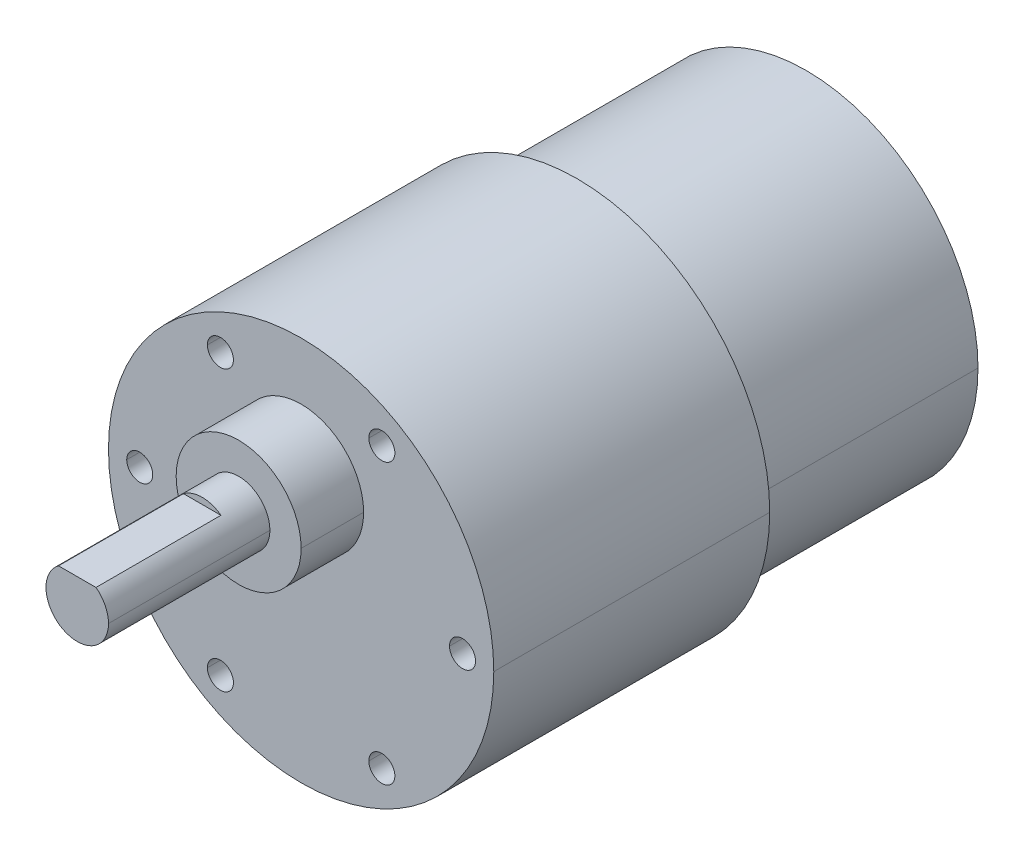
ISO-10303-21;
HEADER;
FILE_DESCRIPTION(('STEP AP214'),'2;1');
FILE_NAME('part.step','',(''),(''),'','','');
FILE_SCHEMA(('AUTOMOTIVE_DESIGN { 1 0 10303 214 1 1 1 1 }'));
ENDSEC;
DATA;
#1=APPLICATION_CONTEXT('core data for automotive mechanical design processes');
#2=APPLICATION_PROTOCOL_DEFINITION('international standard','automotive_design',2000,#1);
#3=PRODUCT_CONTEXT('',#1,'mechanical');
#4=PRODUCT('Part','Part','',(#3));
#5=PRODUCT_RELATED_PRODUCT_CATEGORY('part','',(#4));
#6=PRODUCT_DEFINITION_FORMATION('','',#4);
#7=PRODUCT_DEFINITION_CONTEXT('part definition',#1,'design');
#8=PRODUCT_DEFINITION('design','',#6,#7);
#9=PRODUCT_DEFINITION_SHAPE('','',#8);
#10=(LENGTH_UNIT() NAMED_UNIT(*) SI_UNIT(.MILLI.,.METRE.));
#11=(NAMED_UNIT(*) PLANE_ANGLE_UNIT() SI_UNIT($,.RADIAN.));
#12=(NAMED_UNIT(*) SI_UNIT($,.STERADIAN.) SOLID_ANGLE_UNIT());
#13=UNCERTAINTY_MEASURE_WITH_UNIT(LENGTH_MEASURE(1.E-05),#10,'distance_accuracy_value','');
#14=(GEOMETRIC_REPRESENTATION_CONTEXT(3) GLOBAL_UNCERTAINTY_ASSIGNED_CONTEXT((#13)) GLOBAL_UNIT_ASSIGNED_CONTEXT((#10,
#11,#12)) REPRESENTATION_CONTEXT('',''));
#15=CARTESIAN_POINT('',(0.,0.,0.));
#16=DIRECTION('',(0.,0.,1.));
#17=DIRECTION('',(1.,0.,0.));
#18=AXIS2_PLACEMENT_3D('',#15,#16,#17);
#19=CARTESIAN_POINT('',(0.,0.,-26.5));
#20=DIRECTION('',(0.,0.,-1.));
#21=DIRECTION('',(0.,-1.,0.));
#22=AXIS2_PLACEMENT_3D('',#19,#20,#21);
#23=PLANE('',#22);
#24=CARTESIAN_POINT('',(0.,0.,-26.5));
#25=DIRECTION('',(0.,0.,-1.));
#26=DIRECTION('',(-1.,0.,0.));
#27=AXIS2_PLACEMENT_3D('',#24,#25,#26);
#28=CIRCLE('',#27,9.65740322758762);
#29=CARTESIAN_POINT('',(-9.65740322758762,0.,-26.5));
#30=VERTEX_POINT('',#29);
#31=CARTESIAN_POINT('',(9.65740322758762,0.,-26.5));
#32=VERTEX_POINT('',#31);
#33=EDGE_CURVE('E286',#30,#32,#28,.T.);
#34=ORIENTED_EDGE('',*,*,#33,.T.);
#35=CARTESIAN_POINT('',(0.,0.,-26.5));
#36=DIRECTION('',(0.,0.,-1.));
#37=DIRECTION('',(-1.,0.,0.));
#38=AXIS2_PLACEMENT_3D('',#35,#36,#37);
#39=CIRCLE('',#38,9.65740322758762);
#40=EDGE_CURVE('E10',#32,#30,#39,.T.);
#41=ORIENTED_EDGE('',*,*,#40,.T.);
#42=EDGE_LOOP('',(#34,#41));
#43=FACE_BOUND('',#42,.T.);
#44=ADVANCED_FACE('F16',(#43),#23,.T.);
#45=CARTESIAN_POINT('',(0.,0.,-23.5));
#46=DIRECTION('',(0.,0.,-1.));
#47=DIRECTION('',(-1.,0.,0.));
#48=AXIS2_PLACEMENT_3D('',#45,#46,#47);
#49=CYLINDRICAL_SURFACE('',#48,9.65740322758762);
#50=DIRECTION('',(0.,0.,-1.));
#51=VECTOR('',#50,1.);
#52=CARTESIAN_POINT('',(9.65740322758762,0.,-23.5));
#53=LINE('',#52,#51);
#54=CARTESIAN_POINT('',(9.65740322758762,0.,-24.5));
#55=VERTEX_POINT('',#54);
#56=EDGE_CURVE('E280',#55,#32,#53,.T.);
#57=ORIENTED_EDGE('',*,*,#56,.F.);
#58=CARTESIAN_POINT('',(0.,0.,-24.5));
#59=DIRECTION('',(0.,0.,-1.));
#60=DIRECTION('',(-1.,0.,0.));
#61=AXIS2_PLACEMENT_3D('',#58,#59,#60);
#62=CIRCLE('',#61,9.65740322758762);
#63=CARTESIAN_POINT('',(-9.65740322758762,0.,-24.5));
#64=VERTEX_POINT('',#63);
#65=EDGE_CURVE('E275',#55,#64,#62,.T.);
#66=ORIENTED_EDGE('',*,*,#65,.T.);
#67=DIRECTION('',(0.,0.,-1.));
#68=VECTOR('',#67,1.);
#69=CARTESIAN_POINT('',(-9.65740322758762,0.,-23.5));
#70=LINE('',#69,#68);
#71=EDGE_CURVE('E273',#64,#30,#70,.T.);
#72=ORIENTED_EDGE('',*,*,#71,.T.);
#73=ORIENTED_EDGE('',*,*,#40,.F.);
#74=EDGE_LOOP('',(#57,#66,#72,#73));
#75=FACE_BOUND('',#74,.T.);
#76=ADVANCED_FACE('F18',(#75),#49,.T.);
#77=CARTESIAN_POINT('',(0.,0.,17.5979797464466));
#78=DIRECTION('',(0.,0.,-1.));
#79=DIRECTION('',(-1.,0.,0.));
#80=AXIS2_PLACEMENT_3D('',#77,#78,#79);
#81=CYLINDRICAL_SURFACE('',#80,8.);
#82=DIRECTION('',(0.,0.,-1.));
#83=VECTOR('',#82,1.);
#84=CARTESIAN_POINT('',(8.,0.,17.5979797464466));
#85=LINE('',#84,#83);
#86=CARTESIAN_POINT('',(8.,0.,-22.));
#87=VERTEX_POINT('',#86);
#88=CARTESIAN_POINT('',(8.,0.,-24.5));
#89=VERTEX_POINT('',#88);
#90=EDGE_CURVE('E314',#87,#89,#85,.T.);
#91=ORIENTED_EDGE('',*,*,#90,.F.);
#92=CARTESIAN_POINT('',(0.,0.,-22.));
#93=DIRECTION('',(0.,0.,1.));
#94=DIRECTION('',(-1.,0.,0.));
#95=AXIS2_PLACEMENT_3D('',#92,#93,#94);
#96=CIRCLE('',#95,8.);
#97=CARTESIAN_POINT('',(-8.,0.,-22.));
#98=VERTEX_POINT('',#97);
#99=EDGE_CURVE('E329',#98,#87,#96,.T.);
#100=ORIENTED_EDGE('',*,*,#99,.F.);
#101=DIRECTION('',(0.,0.,-1.));
#102=VECTOR('',#101,1.);
#103=CARTESIAN_POINT('',(-8.,0.,17.5979797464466));
#104=LINE('',#103,#102);
#105=CARTESIAN_POINT('',(-8.,0.,-24.5));
#106=VERTEX_POINT('',#105);
#107=EDGE_CURVE('E321',#98,#106,#104,.T.);
#108=ORIENTED_EDGE('',*,*,#107,.T.);
#109=CARTESIAN_POINT('',(0.,0.,-24.5));
#110=DIRECTION('',(0.,0.,-1.));
#111=DIRECTION('',(-1.,0.,0.));
#112=AXIS2_PLACEMENT_3D('',#109,#110,#111);
#113=CIRCLE('',#112,8.);
#114=EDGE_CURVE('E282',#89,#106,#113,.T.);
#115=ORIENTED_EDGE('',*,*,#114,.F.);
#116=EDGE_LOOP('',(#91,#100,#108,#115));
#117=FACE_BOUND('',#116,.T.);
#118=ADVANCED_FACE('F660',(#117),#81,.T.);
#119=CARTESIAN_POINT('',(-7.75,13.4233937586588,26.5));
#120=DIRECTION('',(0.,0.,1.));
#121=DIRECTION('',(1.,0.,0.));
#122=AXIS2_PLACEMENT_3D('',#119,#120,#121);
#123=CYLINDRICAL_SURFACE('',#122,1.25);
#124=DIRECTION('',(0.,0.,1.));
#125=VECTOR('',#124,1.);
#126=CARTESIAN_POINT('',(-9.,13.4233937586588,26.5));
#127=LINE('',#126,#125);
#128=CARTESIAN_POINT('',(-9.,13.4233937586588,19.));
#129=VERTEX_POINT('',#128);
#130=CARTESIAN_POINT('',(-9.,13.4233937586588,26.5));
#131=VERTEX_POINT('',#130);
#132=EDGE_CURVE('E319',#129,#131,#127,.T.);
#133=ORIENTED_EDGE('',*,*,#132,.F.);
#134=CARTESIAN_POINT('',(-7.75,13.4233937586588,19.));
#135=DIRECTION('',(0.,0.,1.));
#136=DIRECTION('',(1.,0.,0.));
#137=AXIS2_PLACEMENT_3D('',#134,#135,#136);
#138=CIRCLE('',#137,1.25);
#139=CARTESIAN_POINT('',(-6.5,13.4233937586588,19.));
#140=VERTEX_POINT('',#139);
#141=EDGE_CURVE('E20',#140,#129,#138,.T.);
#142=ORIENTED_EDGE('',*,*,#141,.F.);
#143=DIRECTION('',(0.,0.,1.));
#144=VECTOR('',#143,1.);
#145=CARTESIAN_POINT('',(-6.5,13.4233937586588,26.5));
#146=LINE('',#145,#144);
#147=CARTESIAN_POINT('',(-6.5,13.4233937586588,26.5));
#148=VERTEX_POINT('',#147);
#149=EDGE_CURVE('E356',#140,#148,#146,.T.);
#150=ORIENTED_EDGE('',*,*,#149,.T.);
#151=CARTESIAN_POINT('',(-7.75,13.4233937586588,26.5));
#152=DIRECTION('',(0.,0.,1.));
#153=DIRECTION('',(1.,0.,0.));
#154=AXIS2_PLACEMENT_3D('',#151,#152,#153);
#155=CIRCLE('',#154,1.25);
#156=EDGE_CURVE('E572',#148,#131,#155,.T.);
#157=ORIENTED_EDGE('',*,*,#156,.T.);
#158=EDGE_LOOP('',(#133,#142,#150,#157));
#159=FACE_BOUND('',#158,.T.);
#160=ADVANCED_FACE('F624',(#159),#123,.F.);
#161=CARTESIAN_POINT('',(-7.75,13.4233937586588,19.));
#162=DIRECTION('',(0.,0.,1.));
#163=DIRECTION('',(1.,0.,0.));
#164=AXIS2_PLACEMENT_3D('',#161,#162,#163);
#165=CONICAL_SURFACE('',#164,1.25,1.02974425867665);
#166=DIRECTION('',(-0.857167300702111,0.,0.515038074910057));
#167=VECTOR('',#166,1.);
#168=CARTESIAN_POINT('',(-9.,13.4233937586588,19.));
#169=LINE('',#168,#167);
#170=CARTESIAN_POINT('',(-7.75,13.4233937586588,18.2489242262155));
#171=VERTEX_POINT('',#170);
#172=EDGE_CURVE('E303',#171,#129,#169,.T.);
#173=ORIENTED_EDGE('',*,*,#172,.F.);
#174=DIRECTION('',(0.857167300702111,0.,0.515038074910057));
#175=VECTOR('',#174,1.);
#176=CARTESIAN_POINT('',(-6.5,13.4233937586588,19.));
#177=LINE('',#176,#175);
#178=EDGE_CURVE('E305',#171,#140,#177,.T.);
#179=ORIENTED_EDGE('',*,*,#178,.T.);
#180=ORIENTED_EDGE('',*,*,#141,.T.);
#181=EDGE_LOOP('',(#173,#179,#180));
#182=FACE_BOUND('',#181,.T.);
#183=ADVANCED_FACE('F620',(#182),#165,.F.);
#184=CARTESIAN_POINT('',(7.75,13.4233937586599,26.5));
#185=DIRECTION('',(0.,0.,1.));
#186=DIRECTION('',(1.,0.,0.));
#187=AXIS2_PLACEMENT_3D('',#184,#185,#186);
#188=CYLINDRICAL_SURFACE('',#187,1.25);
#189=DIRECTION('',(0.,0.,1.));
#190=VECTOR('',#189,1.);
#191=CARTESIAN_POINT('',(6.5,13.4233937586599,26.5));
#192=LINE('',#191,#190);
#193=CARTESIAN_POINT('',(6.5,13.4233937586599,19.));
#194=VERTEX_POINT('',#193);
#195=CARTESIAN_POINT('',(6.5,13.4233937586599,26.5));
#196=VERTEX_POINT('',#195);
#197=EDGE_CURVE('E359',#194,#196,#192,.T.);
#198=ORIENTED_EDGE('',*,*,#197,.F.);
#199=CARTESIAN_POINT('',(7.75,13.4233937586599,19.));
#200=DIRECTION('',(0.,0.,1.));
#201=DIRECTION('',(1.,0.,0.));
#202=AXIS2_PLACEMENT_3D('',#199,#200,#201);
#203=CIRCLE('',#202,1.25);
#204=CARTESIAN_POINT('',(9.,13.4233937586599,19.));
#205=VERTEX_POINT('',#204);
#206=EDGE_CURVE('E602',#205,#194,#203,.T.);
#207=ORIENTED_EDGE('',*,*,#206,.F.);
#208=DIRECTION('',(0.,0.,1.));
#209=VECTOR('',#208,1.);
#210=CARTESIAN_POINT('',(9.,13.4233937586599,26.5));
#211=LINE('',#210,#209);
#212=CARTESIAN_POINT('',(9.,13.4233937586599,26.5));
#213=VERTEX_POINT('',#212);
#214=EDGE_CURVE('E360',#205,#213,#211,.T.);
#215=ORIENTED_EDGE('',*,*,#214,.T.);
#216=CARTESIAN_POINT('',(7.75,13.4233937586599,26.5));
#217=DIRECTION('',(0.,0.,1.));
#218=DIRECTION('',(1.,0.,0.));
#219=AXIS2_PLACEMENT_3D('',#216,#217,#218);
#220=CIRCLE('',#219,1.25);
#221=EDGE_CURVE('E577',#213,#196,#220,.T.);
#222=ORIENTED_EDGE('',*,*,#221,.T.);
#223=EDGE_LOOP('',(#198,#207,#215,#222));
#224=FACE_BOUND('',#223,.T.);
#225=ADVANCED_FACE('F664',(#224),#188,.F.);
#226=CARTESIAN_POINT('',(7.75,13.4233937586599,19.));
#227=DIRECTION('',(0.,0.,1.));
#228=DIRECTION('',(1.,0.,0.));
#229=AXIS2_PLACEMENT_3D('',#226,#227,#228);
#230=CONICAL_SURFACE('',#229,1.25,1.02974425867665);
#231=DIRECTION('',(-0.857167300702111,0.,0.515038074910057));
#232=VECTOR('',#231,1.);
#233=CARTESIAN_POINT('',(6.5,13.4233937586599,19.));
#234=LINE('',#233,#232);
#235=CARTESIAN_POINT('',(7.75,13.4233937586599,18.2489242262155));
#236=VERTEX_POINT('',#235);
#237=EDGE_CURVE('E393',#236,#194,#234,.T.);
#238=ORIENTED_EDGE('',*,*,#237,.F.);
#239=DIRECTION('',(0.857167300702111,0.,0.515038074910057));
#240=VECTOR('',#239,1.);
#241=CARTESIAN_POINT('',(9.,13.4233937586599,19.));
#242=LINE('',#241,#240);
#243=EDGE_CURVE('E387',#236,#205,#242,.T.);
#244=ORIENTED_EDGE('',*,*,#243,.T.);
#245=ORIENTED_EDGE('',*,*,#206,.T.);
#246=EDGE_LOOP('',(#238,#244,#245));
#247=FACE_BOUND('',#246,.T.);
#248=ADVANCED_FACE('F661',(#247),#230,.F.);
#249=CARTESIAN_POINT('',(15.500000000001,1.66495789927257E-12,26.5));
#250=DIRECTION('',(0.,0.,1.));
#251=DIRECTION('',(1.,0.,0.));
#252=AXIS2_PLACEMENT_3D('',#249,#250,#251);
#253=CYLINDRICAL_SURFACE('',#252,1.25);
#254=DIRECTION('',(0.,0.,1.));
#255=VECTOR('',#254,1.);
#256=CARTESIAN_POINT('',(14.2500000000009,1.66511098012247E-12,26.5));
#257=LINE('',#256,#255);
#258=CARTESIAN_POINT('',(14.2500000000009,1.66511098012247E-12,19.));
#259=VERTEX_POINT('',#258);
#260=CARTESIAN_POINT('',(14.2500000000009,1.66511098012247E-12,26.5));
#261=VERTEX_POINT('',#260);
#262=EDGE_CURVE('E401',#259,#261,#257,.T.);
#263=ORIENTED_EDGE('',*,*,#262,.F.);
#264=CARTESIAN_POINT('',(15.500000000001,1.66495789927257E-12,19.));
#265=DIRECTION('',(0.,0.,1.));
#266=DIRECTION('',(1.,0.,0.));
#267=AXIS2_PLACEMENT_3D('',#264,#265,#266);
#268=CIRCLE('',#267,1.25);
#269=CARTESIAN_POINT('',(16.750000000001,1.66495789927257E-12,19.));
#270=VERTEX_POINT('',#269);
#271=EDGE_CURVE('E601',#270,#259,#268,.T.);
#272=ORIENTED_EDGE('',*,*,#271,.F.);
#273=DIRECTION('',(0.,0.,1.));
#274=VECTOR('',#273,1.);
#275=CARTESIAN_POINT('',(16.750000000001,1.66495789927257E-12,26.5));
#276=LINE('',#275,#274);
#277=CARTESIAN_POINT('',(16.750000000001,1.66495789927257E-12,26.5));
#278=VERTEX_POINT('',#277);
#279=EDGE_CURVE('E418',#270,#278,#276,.T.);
#280=ORIENTED_EDGE('',*,*,#279,.T.);
#281=CARTESIAN_POINT('',(15.500000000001,1.66495789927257E-12,26.5));
#282=DIRECTION('',(0.,0.,1.));
#283=DIRECTION('',(1.,0.,0.));
#284=AXIS2_PLACEMENT_3D('',#281,#282,#283);
#285=CIRCLE('',#284,1.25);
#286=EDGE_CURVE('E540',#278,#261,#285,.T.);
#287=ORIENTED_EDGE('',*,*,#286,.T.);
#288=EDGE_LOOP('',(#263,#272,#280,#287));
#289=FACE_BOUND('',#288,.T.);
#290=ADVANCED_FACE('F667',(#289),#253,.F.);
#291=CARTESIAN_POINT('',(15.500000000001,1.66495789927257E-12,19.));
#292=DIRECTION('',(0.,0.,1.));
#293=DIRECTION('',(1.,0.,0.));
#294=AXIS2_PLACEMENT_3D('',#291,#292,#293);
#295=CONICAL_SURFACE('',#294,1.25,1.02974425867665);
#296=DIRECTION('',(-0.857167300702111,0.,0.515038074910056));
#297=VECTOR('',#296,1.);
#298=CARTESIAN_POINT('',(14.2500000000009,1.66511098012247E-12,19.));
#299=LINE('',#298,#297);
#300=CARTESIAN_POINT('',(15.500000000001,1.66495789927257E-12,18.2489242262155));
#301=VERTEX_POINT('',#300);
#302=EDGE_CURVE('E434',#301,#259,#299,.T.);
#303=ORIENTED_EDGE('',*,*,#302,.F.);
#304=DIRECTION('',(0.857167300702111,0.,0.515038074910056));
#305=VECTOR('',#304,1.);
#306=CARTESIAN_POINT('',(16.750000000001,1.66495789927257E-12,19.));
#307=LINE('',#306,#305);
#308=EDGE_CURVE('E431',#301,#270,#307,.T.);
#309=ORIENTED_EDGE('',*,*,#308,.T.);
#310=ORIENTED_EDGE('',*,*,#271,.T.);
#311=EDGE_LOOP('',(#303,#309,#310));
#312=FACE_BOUND('',#311,.T.);
#313=ADVANCED_FACE('F670',(#312),#295,.F.);
#314=CARTESIAN_POINT('',(7.75000000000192,-13.4233937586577,26.5));
#315=DIRECTION('',(0.,0.,1.));
#316=DIRECTION('',(1.,0.,0.));
#317=AXIS2_PLACEMENT_3D('',#314,#315,#316);
#318=CYLINDRICAL_SURFACE('',#317,1.25);
#319=DIRECTION('',(0.,0.,1.));
#320=VECTOR('',#319,1.);
#321=CARTESIAN_POINT('',(6.50000000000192,-13.4233937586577,26.5));
#322=LINE('',#321,#320);
#323=CARTESIAN_POINT('',(6.50000000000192,-13.4233937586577,19.));
#324=VERTEX_POINT('',#323);
#325=CARTESIAN_POINT('',(6.50000000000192,-13.4233937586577,26.5));
#326=VERTEX_POINT('',#325);
#327=EDGE_CURVE('E447',#324,#326,#322,.T.);
#328=ORIENTED_EDGE('',*,*,#327,.F.);
#329=CARTESIAN_POINT('',(7.75000000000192,-13.4233937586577,19.));
#330=DIRECTION('',(0.,0.,1.));
#331=DIRECTION('',(1.,0.,0.));
#332=AXIS2_PLACEMENT_3D('',#329,#330,#331);
#333=CIRCLE('',#332,1.25);
#334=CARTESIAN_POINT('',(9.00000000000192,-13.4233937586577,19.));
#335=VERTEX_POINT('',#334);
#336=EDGE_CURVE('E598',#335,#324,#333,.T.);
#337=ORIENTED_EDGE('',*,*,#336,.F.);
#338=DIRECTION('',(0.,0.,1.));
#339=VECTOR('',#338,1.);
#340=CARTESIAN_POINT('',(9.00000000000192,-13.4233937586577,26.5));
#341=LINE('',#340,#339);
#342=CARTESIAN_POINT('',(9.00000000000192,-13.4233937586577,26.5));
#343=VERTEX_POINT('',#342);
#344=EDGE_CURVE('E453',#335,#343,#341,.T.);
#345=ORIENTED_EDGE('',*,*,#344,.T.);
#346=CARTESIAN_POINT('',(7.75000000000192,-13.4233937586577,26.5));
#347=DIRECTION('',(0.,0.,1.));
#348=DIRECTION('',(1.,0.,0.));
#349=AXIS2_PLACEMENT_3D('',#346,#347,#348);
#350=CIRCLE('',#349,1.25);
#351=EDGE_CURVE('E531',#343,#326,#350,.T.);
#352=ORIENTED_EDGE('',*,*,#351,.T.);
#353=EDGE_LOOP('',(#328,#337,#345,#352));
#354=FACE_BOUND('',#353,.T.);
#355=ADVANCED_FACE('F676',(#354),#318,.F.);
#356=CARTESIAN_POINT('',(7.75000000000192,-13.4233937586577,19.));
#357=DIRECTION('',(0.,0.,1.));
#358=DIRECTION('',(1.,0.,0.));
#359=AXIS2_PLACEMENT_3D('',#356,#357,#358);
#360=CONICAL_SURFACE('',#359,1.25,1.02974425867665);
#361=DIRECTION('',(-0.857167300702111,0.,0.515038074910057));
#362=VECTOR('',#361,1.);
#363=CARTESIAN_POINT('',(6.50000000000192,-13.4233937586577,19.));
#364=LINE('',#363,#362);
#365=CARTESIAN_POINT('',(7.75000000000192,-13.4233937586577,18.2489242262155));
#366=VERTEX_POINT('',#365);
#367=EDGE_CURVE('E343',#366,#324,#364,.T.);
#368=ORIENTED_EDGE('',*,*,#367,.F.);
#369=DIRECTION('',(0.857167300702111,0.,0.515038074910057));
#370=VECTOR('',#369,1.);
#371=CARTESIAN_POINT('',(9.00000000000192,-13.4233937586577,19.));
#372=LINE('',#371,#370);
#373=EDGE_CURVE('E388',#366,#335,#372,.T.);
#374=ORIENTED_EDGE('',*,*,#373,.T.);
#375=ORIENTED_EDGE('',*,*,#336,.T.);
#376=EDGE_LOOP('',(#368,#374,#375));
#377=FACE_BOUND('',#376,.T.);
#378=ADVANCED_FACE('F679',(#377),#360,.F.);
#379=CARTESIAN_POINT('',(-7.74999999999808,-13.4233937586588,26.5));
#380=DIRECTION('',(0.,0.,1.));
#381=DIRECTION('',(1.,0.,0.));
#382=AXIS2_PLACEMENT_3D('',#379,#380,#381);
#383=CYLINDRICAL_SURFACE('',#382,1.25);
#384=DIRECTION('',(0.,0.,1.));
#385=VECTOR('',#384,1.);
#386=CARTESIAN_POINT('',(-8.99999999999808,-13.4233937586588,26.5));
#387=LINE('',#386,#385);
#388=CARTESIAN_POINT('',(-8.99999999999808,-13.4233937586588,19.));
#389=VERTEX_POINT('',#388);
#390=CARTESIAN_POINT('',(-8.99999999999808,-13.4233937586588,26.5));
#391=VERTEX_POINT('',#390);
#392=EDGE_CURVE('E341',#389,#391,#387,.T.);
#393=ORIENTED_EDGE('',*,*,#392,.F.);
#394=CARTESIAN_POINT('',(-7.74999999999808,-13.4233937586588,19.));
#395=DIRECTION('',(0.,0.,1.));
#396=DIRECTION('',(1.,0.,0.));
#397=AXIS2_PLACEMENT_3D('',#394,#395,#396);
#398=CIRCLE('',#397,1.25);
#399=CARTESIAN_POINT('',(-6.49999999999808,-13.4233937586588,19.));
#400=VERTEX_POINT('',#399);
#401=EDGE_CURVE('E328',#400,#389,#398,.T.);
#402=ORIENTED_EDGE('',*,*,#401,.F.);
#403=DIRECTION('',(0.,0.,1.));
#404=VECTOR('',#403,1.);
#405=CARTESIAN_POINT('',(-6.49999999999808,-13.4233937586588,26.5));
#406=LINE('',#405,#404);
#407=CARTESIAN_POINT('',(-6.49999999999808,-13.4233937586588,26.5));
#408=VERTEX_POINT('',#407);
#409=EDGE_CURVE('E466',#400,#408,#406,.T.);
#410=ORIENTED_EDGE('',*,*,#409,.T.);
#411=CARTESIAN_POINT('',(-7.74999999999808,-13.4233937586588,26.5));
#412=DIRECTION('',(0.,0.,1.));
#413=DIRECTION('',(1.,0.,0.));
#414=AXIS2_PLACEMENT_3D('',#411,#412,#413);
#415=CIRCLE('',#414,1.25);
#416=EDGE_CURVE('E536',#408,#391,#415,.T.);
#417=ORIENTED_EDGE('',*,*,#416,.T.);
#418=EDGE_LOOP('',(#393,#402,#410,#417));
#419=FACE_BOUND('',#418,.T.);
#420=ADVANCED_FACE('F683',(#419),#383,.F.);
#421=CARTESIAN_POINT('',(-7.74999999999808,-13.4233937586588,19.));
#422=DIRECTION('',(0.,0.,1.));
#423=DIRECTION('',(1.,0.,0.));
#424=AXIS2_PLACEMENT_3D('',#421,#422,#423);
#425=CONICAL_SURFACE('',#424,1.25,1.02974425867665);
#426=DIRECTION('',(-0.857167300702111,0.,0.515038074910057));
#427=VECTOR('',#426,1.);
#428=CARTESIAN_POINT('',(-8.99999999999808,-13.4233937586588,19.));
#429=LINE('',#428,#427);
#430=CARTESIAN_POINT('',(-7.74999999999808,-13.4233937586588,18.2489242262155));
#431=VERTEX_POINT('',#430);
#432=EDGE_CURVE('E477',#431,#389,#429,.T.);
#433=ORIENTED_EDGE('',*,*,#432,.F.);
#434=DIRECTION('',(0.857167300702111,0.,0.515038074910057));
#435=VECTOR('',#434,1.);
#436=CARTESIAN_POINT('',(-6.49999999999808,-13.4233937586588,19.));
#437=LINE('',#436,#435);
#438=EDGE_CURVE('E478',#431,#400,#437,.T.);
#439=ORIENTED_EDGE('',*,*,#438,.T.);
#440=ORIENTED_EDGE('',*,*,#401,.T.);
#441=EDGE_LOOP('',(#433,#439,#440));
#442=FACE_BOUND('',#441,.T.);
#443=ADVANCED_FACE('F688',(#442),#425,.F.);
#444=CARTESIAN_POINT('',(-15.4999999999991,-5.84225173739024E-13,26.5));
#445=DIRECTION('',(0.,0.,1.));
#446=DIRECTION('',(1.,0.,0.));
#447=AXIS2_PLACEMENT_3D('',#444,#445,#446);
#448=CYLINDRICAL_SURFACE('',#447,1.25);
#449=DIRECTION('',(0.,0.,1.));
#450=VECTOR('',#449,1.);
#451=CARTESIAN_POINT('',(-16.7499999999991,-5.8407209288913E-13,26.5));
#452=LINE('',#451,#450);
#453=CARTESIAN_POINT('',(-16.7499999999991,-5.8407209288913E-13,19.));
#454=VERTEX_POINT('',#453);
#455=CARTESIAN_POINT('',(-16.7499999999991,-5.8407209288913E-13,26.5));
#456=VERTEX_POINT('',#455);
#457=EDGE_CURVE('E488',#454,#456,#452,.T.);
#458=ORIENTED_EDGE('',*,*,#457,.F.);
#459=CARTESIAN_POINT('',(-15.4999999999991,-5.84225173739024E-13,19.));
#460=DIRECTION('',(0.,0.,1.));
#461=DIRECTION('',(1.,0.,0.));
#462=AXIS2_PLACEMENT_3D('',#459,#460,#461);
#463=CIRCLE('',#462,1.25);
#464=CARTESIAN_POINT('',(-14.2499999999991,-5.84225173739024E-13,19.));
#465=VERTEX_POINT('',#464);
#466=EDGE_CURVE('E326',#465,#454,#463,.T.);
#467=ORIENTED_EDGE('',*,*,#466,.F.);
#468=DIRECTION('',(0.,0.,1.));
#469=VECTOR('',#468,1.);
#470=CARTESIAN_POINT('',(-14.2499999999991,-5.84225173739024E-13,26.5));
#471=LINE('',#470,#469);
#472=CARTESIAN_POINT('',(-14.2499999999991,-5.84225173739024E-13,26.5));
#473=VERTEX_POINT('',#472);
#474=EDGE_CURVE('E501',#465,#473,#471,.T.);
#475=ORIENTED_EDGE('',*,*,#474,.T.);
#476=CARTESIAN_POINT('',(-15.4999999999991,-5.84225173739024E-13,26.5));
#477=DIRECTION('',(0.,0.,1.));
#478=DIRECTION('',(1.,0.,0.));
#479=AXIS2_PLACEMENT_3D('',#476,#477,#478);
#480=CIRCLE('',#479,1.25);
#481=EDGE_CURVE('E581',#473,#456,#480,.T.);
#482=ORIENTED_EDGE('',*,*,#481,.T.);
#483=EDGE_LOOP('',(#458,#467,#475,#482));
#484=FACE_BOUND('',#483,.T.);
#485=ADVANCED_FACE('F687',(#484),#448,.F.);
#486=CARTESIAN_POINT('',(-15.4999999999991,-5.84225173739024E-13,19.));
#487=DIRECTION('',(0.,0.,1.));
#488=DIRECTION('',(1.,0.,0.));
#489=AXIS2_PLACEMENT_3D('',#486,#487,#488);
#490=CONICAL_SURFACE('',#489,1.25,1.02974425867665);
#491=DIRECTION('',(-0.857167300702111,0.,0.515038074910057));
#492=VECTOR('',#491,1.);
#493=CARTESIAN_POINT('',(-16.7499999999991,-5.8407209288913E-13,19.));
#494=LINE('',#493,#492);
#495=CARTESIAN_POINT('',(-15.4999999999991,-5.84225173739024E-13,18.2489242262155));
#496=VERTEX_POINT('',#495);
#497=EDGE_CURVE('E366',#496,#454,#494,.T.);
#498=ORIENTED_EDGE('',*,*,#497,.F.);
#499=DIRECTION('',(0.857167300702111,0.,0.515038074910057));
#500=VECTOR('',#499,1.);
#501=CARTESIAN_POINT('',(-14.2499999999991,-5.84225173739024E-13,19.));
#502=LINE('',#501,#500);
#503=EDGE_CURVE('E505',#496,#465,#502,.T.);
#504=ORIENTED_EDGE('',*,*,#503,.T.);
#505=ORIENTED_EDGE('',*,*,#466,.T.);
#506=EDGE_LOOP('',(#498,#504,#505));
#507=FACE_BOUND('',#506,.T.);
#508=ADVANCED_FACE('F686',(#507),#490,.F.);
#509=CARTESIAN_POINT('',(0.,0.,-22.));
#510=DIRECTION('',(0.,0.,-1.));
#511=DIRECTION('',(0.,-1.,0.));
#512=AXIS2_PLACEMENT_3D('',#509,#510,#511);
#513=PLANE('',#512);
#514=ORIENTED_EDGE('',*,*,#99,.T.);
#515=CARTESIAN_POINT('',(0.,0.,-22.));
#516=DIRECTION('',(0.,0.,1.));
#517=DIRECTION('',(-1.,0.,0.));
#518=AXIS2_PLACEMENT_3D('',#515,#516,#517);
#519=CIRCLE('',#518,8.);
#520=EDGE_CURVE('E295',#87,#98,#519,.T.);
#521=ORIENTED_EDGE('',*,*,#520,.T.);
#522=EDGE_LOOP('',(#514,#521));
#523=FACE_BOUND('',#522,.T.);
#524=CARTESIAN_POINT('',(0.,0.,-22.));
#525=DIRECTION('',(0.,0.,-1.));
#526=DIRECTION('',(-1.,0.,0.));
#527=AXIS2_PLACEMENT_3D('',#524,#525,#526);
#528=CIRCLE('',#527,16.5);
#529=CARTESIAN_POINT('',(16.5,0.,-22.));
#530=VERTEX_POINT('',#529);
#531=CARTESIAN_POINT('',(-16.5,0.,-22.));
#532=VERTEX_POINT('',#531);
#533=EDGE_CURVE('E472',#530,#532,#528,.T.);
#534=ORIENTED_EDGE('',*,*,#533,.T.);
#535=CARTESIAN_POINT('',(0.,0.,-22.));
#536=DIRECTION('',(0.,0.,-1.));
#537=DIRECTION('',(-1.,0.,0.));
#538=AXIS2_PLACEMENT_3D('',#535,#536,#537);
#539=CIRCLE('',#538,16.5);
#540=EDGE_CURVE('E361',#532,#530,#539,.T.);
#541=ORIENTED_EDGE('',*,*,#540,.T.);
#542=EDGE_LOOP('',(#534,#541));
#543=FACE_BOUND('',#542,.T.);
#544=ADVANCED_FACE('F695',(#523,#543),#513,.T.);
#545=CARTESIAN_POINT('',(0.,0.,-22.));
#546=DIRECTION('',(0.,0.,1.));
#547=DIRECTION('',(1.,0.,0.));
#548=AXIS2_PLACEMENT_3D('',#545,#546,#547);
#549=CYLINDRICAL_SURFACE('',#548,16.5);
#550=DIRECTION('',(0.,0.,1.));
#551=VECTOR('',#550,1.);
#552=CARTESIAN_POINT('',(-16.5,0.,-22.));
#553=LINE('',#552,#551);
#554=CARTESIAN_POINT('',(-16.5,0.,0.));
#555=VERTEX_POINT('',#554);
#556=EDGE_CURVE('E370',#532,#555,#553,.T.);
#557=ORIENTED_EDGE('',*,*,#556,.F.);
#558=ORIENTED_EDGE('',*,*,#533,.F.);
#559=DIRECTION('',(0.,0.,1.));
#560=VECTOR('',#559,1.);
#561=CARTESIAN_POINT('',(16.5,0.,-22.));
#562=LINE('',#561,#560);
#563=CARTESIAN_POINT('',(16.5,0.,0.));
#564=VERTEX_POINT('',#563);
#565=EDGE_CURVE('E518',#530,#564,#562,.T.);
#566=ORIENTED_EDGE('',*,*,#565,.T.);
#567=CARTESIAN_POINT('',(0.,0.,0.));
#568=DIRECTION('',(0.,0.,-1.));
#569=DIRECTION('',(1.,0.,0.));
#570=AXIS2_PLACEMENT_3D('',#567,#568,#569);
#571=CIRCLE('',#570,16.5);
#572=EDGE_CURVE('E492',#564,#555,#571,.T.);
#573=ORIENTED_EDGE('',*,*,#572,.T.);
#574=EDGE_LOOP('',(#557,#558,#566,#573));
#575=FACE_BOUND('',#574,.T.);
#576=ADVANCED_FACE('F696',(#575),#549,.T.);
#577=CARTESIAN_POINT('',(-2.92302524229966,9.4,36.));
#578=DIRECTION('',(0.,-1.,0.));
#579=DIRECTION('',(0.,0.,-1.));
#580=AXIS2_PLACEMENT_3D('',#577,#578,#579);
#581=PLANE('',#580);
#582=DIRECTION('',(1.,0.,0.));
#583=VECTOR('',#582,1.);
#584=CARTESIAN_POINT('',(0.,9.4,48.));
#585=LINE('',#584,#583);
#586=CARTESIAN_POINT('',(-1.8,9.4,48.));
#587=VERTEX_POINT('',#586);
#588=CARTESIAN_POINT('',(1.8,9.4,48.));
#589=VERTEX_POINT('',#588);
#590=EDGE_CURVE('E375',#587,#589,#585,.T.);
#591=ORIENTED_EDGE('',*,*,#590,.T.);
#592=DIRECTION('',(0.,0.,1.));
#593=VECTOR('',#592,1.);
#594=CARTESIAN_POINT('',(1.8,9.4,48.));
#595=LINE('',#594,#593);
#596=CARTESIAN_POINT('',(1.8,9.4,36.));
#597=VERTEX_POINT('',#596);
#598=EDGE_CURVE('E410',#597,#589,#595,.T.);
#599=ORIENTED_EDGE('',*,*,#598,.F.);
#600=DIRECTION('',(1.,0.,0.));
#601=VECTOR('',#600,1.);
#602=CARTESIAN_POINT('',(-2.92302524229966,9.4,36.));
#603=LINE('',#602,#601);
#604=CARTESIAN_POINT('',(-1.8,9.4,36.));
#605=VERTEX_POINT('',#604);
#606=EDGE_CURVE('E374',#605,#597,#603,.T.);
#607=ORIENTED_EDGE('',*,*,#606,.F.);
#608=DIRECTION('',(0.,0.,-1.));
#609=VECTOR('',#608,1.);
#610=CARTESIAN_POINT('',(-1.8,9.4,48.));
#611=LINE('',#610,#609);
#612=EDGE_CURVE('E544',#587,#605,#611,.T.);
#613=ORIENTED_EDGE('',*,*,#612,.F.);
#614=EDGE_LOOP('',(#591,#599,#607,#613));
#615=FACE_BOUND('',#614,.T.);
#616=ADVANCED_FACE('F705',(#615),#581,.F.);
#617=CARTESIAN_POINT('',(0.,0.,36.));
#618=DIRECTION('',(0.,0.,1.));
#619=DIRECTION('',(1.,0.,0.));
#620=AXIS2_PLACEMENT_3D('',#617,#618,#619);
#621=PLANE('',#620);
#622=CARTESIAN_POINT('',(0.,7.,36.));
#623=DIRECTION('',(0.,0.,1.));
#624=DIRECTION('',(1.,0.,0.));
#625=AXIS2_PLACEMENT_3D('',#622,#623,#624);
#626=CIRCLE('',#625,3.);
#627=EDGE_CURVE('E415',#597,#605,#626,.T.);
#628=ORIENTED_EDGE('',*,*,#627,.T.);
#629=ORIENTED_EDGE('',*,*,#606,.T.);
#630=EDGE_LOOP('',(#628,#629));
#631=FACE_BOUND('',#630,.T.);
#632=ADVANCED_FACE('F706',(#631),#621,.T.);
#633=CARTESIAN_POINT('',(0.,7.,48.));
#634=DIRECTION('',(0.,0.,1.));
#635=DIRECTION('',(1.,0.,0.));
#636=AXIS2_PLACEMENT_3D('',#633,#634,#635);
#637=PLANE('',#636);
#638=ORIENTED_EDGE('',*,*,#590,.F.);
#639=CARTESIAN_POINT('',(0.,7.,48.));
#640=DIRECTION('',(0.,0.,1.));
#641=DIRECTION('',(1.,0.,0.));
#642=AXIS2_PLACEMENT_3D('',#639,#640,#641);
#643=CIRCLE('',#642,3.);
#644=CARTESIAN_POINT('',(-3.,7.,48.));
#645=VERTEX_POINT('',#644);
#646=EDGE_CURVE('E541',#587,#645,#643,.T.);
#647=ORIENTED_EDGE('',*,*,#646,.T.);
#648=CARTESIAN_POINT('',(0.,7.,48.));
#649=DIRECTION('',(0.,0.,1.));
#650=DIRECTION('',(1.,0.,0.));
#651=AXIS2_PLACEMENT_3D('',#648,#649,#650);
#652=CIRCLE('',#651,3.);
#653=CARTESIAN_POINT('',(3.,7.,48.));
#654=VERTEX_POINT('',#653);
#655=EDGE_CURVE('E376',#645,#654,#652,.T.);
#656=ORIENTED_EDGE('',*,*,#655,.T.);
#657=CARTESIAN_POINT('',(0.,7.,48.));
#658=DIRECTION('',(0.,0.,1.));
#659=DIRECTION('',(1.,0.,0.));
#660=AXIS2_PLACEMENT_3D('',#657,#658,#659);
#661=CIRCLE('',#660,3.);
#662=EDGE_CURVE('E528',#654,#589,#661,.T.);
#663=ORIENTED_EDGE('',*,*,#662,.T.);
#664=EDGE_LOOP('',(#638,#647,#656,#663));
#665=FACE_BOUND('',#664,.T.);
#666=ADVANCED_FACE('F709',(#665),#637,.T.);
#667=CARTESIAN_POINT('',(0.,7.,48.));
#668=DIRECTION('',(0.,0.,-1.));
#669=DIRECTION('',(-1.,0.,0.));
#670=AXIS2_PLACEMENT_3D('',#667,#668,#669);
#671=CYLINDRICAL_SURFACE('',#670,3.);
#672=DIRECTION('',(0.,0.,-1.));
#673=VECTOR('',#672,1.);
#674=CARTESIAN_POINT('',(3.,7.,48.));
#675=LINE('',#674,#673);
#676=CARTESIAN_POINT('',(3.,7.,32.5));
#677=VERTEX_POINT('',#676);
#678=EDGE_CURVE('E430',#654,#677,#675,.T.);
#679=ORIENTED_EDGE('',*,*,#678,.F.);
#680=ORIENTED_EDGE('',*,*,#655,.F.);
#681=DIRECTION('',(0.,0.,-1.));
#682=VECTOR('',#681,1.);
#683=CARTESIAN_POINT('',(-3.,7.,48.));
#684=LINE('',#683,#682);
#685=CARTESIAN_POINT('',(-3.,7.,32.5));
#686=VERTEX_POINT('',#685);
#687=EDGE_CURVE('E426',#645,#686,#684,.T.);
#688=ORIENTED_EDGE('',*,*,#687,.T.);
#689=CARTESIAN_POINT('',(0.,7.,32.5));
#690=DIRECTION('',(0.,0.,1.));
#691=DIRECTION('',(1.,0.,0.));
#692=AXIS2_PLACEMENT_3D('',#689,#690,#691);
#693=CIRCLE('',#692,3.);
#694=EDGE_CURVE('E547',#686,#677,#693,.T.);
#695=ORIENTED_EDGE('',*,*,#694,.T.);
#696=EDGE_LOOP('',(#679,#680,#688,#695));
#697=FACE_BOUND('',#696,.T.);
#698=ADVANCED_FACE('F713',(#697),#671,.T.);
#699=CARTESIAN_POINT('',(0.,7.,32.5));
#700=DIRECTION('',(0.,0.,1.));
#701=DIRECTION('',(1.,0.,0.));
#702=AXIS2_PLACEMENT_3D('',#699,#700,#701);
#703=PLANE('',#702);
#704=ORIENTED_EDGE('',*,*,#694,.F.);
#705=CARTESIAN_POINT('',(0.,7.,32.5));
#706=DIRECTION('',(0.,0.,1.));
#707=DIRECTION('',(1.,0.,0.));
#708=AXIS2_PLACEMENT_3D('',#705,#706,#707);
#709=CIRCLE('',#708,3.);
#710=EDGE_CURVE('E425',#677,#686,#709,.T.);
#711=ORIENTED_EDGE('',*,*,#710,.F.);
#712=EDGE_LOOP('',(#704,#711));
#713=FACE_BOUND('',#712,.T.);
#714=CARTESIAN_POINT('',(0.,7.,32.5));
#715=DIRECTION('',(0.,0.,1.));
#716=DIRECTION('',(1.,0.,0.));
#717=AXIS2_PLACEMENT_3D('',#714,#715,#716);
#718=CIRCLE('',#717,6.);
#719=CARTESIAN_POINT('',(-6.,7.,32.5));
#720=VERTEX_POINT('',#719);
#721=CARTESIAN_POINT('',(6.,7.,32.5));
#722=VERTEX_POINT('',#721);
#723=EDGE_CURVE('E497',#720,#722,#718,.T.);
#724=ORIENTED_EDGE('',*,*,#723,.T.);
#725=CARTESIAN_POINT('',(0.,7.,32.5));
#726=DIRECTION('',(0.,0.,1.));
#727=DIRECTION('',(1.,0.,0.));
#728=AXIS2_PLACEMENT_3D('',#725,#726,#727);
#729=CIRCLE('',#728,6.);
#730=EDGE_CURVE('E412',#722,#720,#729,.T.);
#731=ORIENTED_EDGE('',*,*,#730,.T.);
#732=EDGE_LOOP('',(#724,#731));
#733=FACE_BOUND('',#732,.T.);
#734=ADVANCED_FACE('F647',(#713,#733),#703,.T.);
#735=CARTESIAN_POINT('',(0.,7.,32.5));
#736=DIRECTION('',(0.,0.,-1.));
#737=DIRECTION('',(-1.,0.,0.));
#738=AXIS2_PLACEMENT_3D('',#735,#736,#737);
#739=CYLINDRICAL_SURFACE('',#738,6.);
#740=DIRECTION('',(0.,0.,-1.));
#741=VECTOR('',#740,1.);
#742=CARTESIAN_POINT('',(6.,7.,32.5));
#743=LINE('',#742,#741);
#744=CARTESIAN_POINT('',(6.,7.,26.5));
#745=VERTEX_POINT('',#744);
#746=EDGE_CURVE('E436',#722,#745,#743,.T.);
#747=ORIENTED_EDGE('',*,*,#746,.F.);
#748=ORIENTED_EDGE('',*,*,#723,.F.);
#749=DIRECTION('',(0.,0.,-1.));
#750=VECTOR('',#749,1.);
#751=CARTESIAN_POINT('',(-6.,7.,32.5));
#752=LINE('',#751,#750);
#753=CARTESIAN_POINT('',(-6.,7.,26.5));
#754=VERTEX_POINT('',#753);
#755=EDGE_CURVE('E332',#720,#754,#752,.T.);
#756=ORIENTED_EDGE('',*,*,#755,.T.);
#757=CARTESIAN_POINT('',(0.,7.,26.5));
#758=DIRECTION('',(0.,0.,1.));
#759=DIRECTION('',(1.,0.,0.));
#760=AXIS2_PLACEMENT_3D('',#757,#758,#759);
#761=CIRCLE('',#760,6.);
#762=EDGE_CURVE('E500',#754,#745,#761,.T.);
#763=ORIENTED_EDGE('',*,*,#762,.T.);
#764=EDGE_LOOP('',(#747,#748,#756,#763));
#765=FACE_BOUND('',#764,.T.);
#766=ADVANCED_FACE('F645',(#765),#739,.T.);
#767=CARTESIAN_POINT('',(0.,0.,0.));
#768=DIRECTION('',(0.,0.,1.));
#769=DIRECTION('',(1.,0.,0.));
#770=AXIS2_PLACEMENT_3D('',#767,#768,#769);
#771=PLANE('',#770);
#772=ORIENTED_EDGE('',*,*,#572,.F.);
#773=CARTESIAN_POINT('',(0.,0.,0.));
#774=DIRECTION('',(0.,0.,-1.));
#775=DIRECTION('',(1.,0.,0.));
#776=AXIS2_PLACEMENT_3D('',#773,#774,#775);
#777=CIRCLE('',#776,16.5);
#778=EDGE_CURVE('E514',#555,#564,#777,.T.);
#779=ORIENTED_EDGE('',*,*,#778,.F.);
#780=EDGE_LOOP('',(#772,#779));
#781=FACE_BOUND('',#780,.T.);
#782=CARTESIAN_POINT('',(0.,0.,0.));
#783=DIRECTION('',(0.,0.,1.));
#784=DIRECTION('',(1.,0.,0.));
#785=AXIS2_PLACEMENT_3D('',#782,#783,#784);
#786=CIRCLE('',#785,18.5);
#787=CARTESIAN_POINT('',(-18.5,0.,0.));
#788=VERTEX_POINT('',#787);
#789=CARTESIAN_POINT('',(18.5,0.,0.));
#790=VERTEX_POINT('',#789);
#791=EDGE_CURVE('E40',#788,#790,#786,.T.);
#792=ORIENTED_EDGE('',*,*,#791,.F.);
#793=CARTESIAN_POINT('',(0.,0.,0.));
#794=DIRECTION('',(0.,0.,1.));
#795=DIRECTION('',(1.,0.,0.));
#796=AXIS2_PLACEMENT_3D('',#793,#794,#795);
#797=CIRCLE('',#796,18.5);
#798=EDGE_CURVE('E525',#790,#788,#797,.T.);
#799=ORIENTED_EDGE('',*,*,#798,.F.);
#800=EDGE_LOOP('',(#792,#799));
#801=FACE_BOUND('',#800,.T.);
#802=ADVANCED_FACE('F631',(#781,#801),#771,.F.);
#803=CARTESIAN_POINT('',(0.,0.,26.5));
#804=DIRECTION('',(0.,0.,1.));
#805=DIRECTION('',(1.,0.,0.));
#806=AXIS2_PLACEMENT_3D('',#803,#804,#805);
#807=PLANE('',#806);
#808=ORIENTED_EDGE('',*,*,#762,.F.);
#809=CARTESIAN_POINT('',(0.,7.,26.5));
#810=DIRECTION('',(0.,0.,1.));
#811=DIRECTION('',(1.,0.,0.));
#812=AXIS2_PLACEMENT_3D('',#809,#810,#811);
#813=CIRCLE('',#812,6.);
#814=EDGE_CURVE('E336',#745,#754,#813,.T.);
#815=ORIENTED_EDGE('',*,*,#814,.F.);
#816=EDGE_LOOP('',(#808,#815));
#817=FACE_BOUND('',#816,.T.);
#818=ORIENTED_EDGE('',*,*,#481,.F.);
#819=CARTESIAN_POINT('',(-15.4999999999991,-5.84225173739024E-13,26.5));
#820=DIRECTION('',(0.,0.,1.));
#821=DIRECTION('',(1.,0.,0.));
#822=AXIS2_PLACEMENT_3D('',#819,#820,#821);
#823=CIRCLE('',#822,1.25);
#824=EDGE_CURVE('E495',#456,#473,#823,.T.);
#825=ORIENTED_EDGE('',*,*,#824,.F.);
#826=EDGE_LOOP('',(#818,#825));
#827=FACE_BOUND('',#826,.T.);
#828=ORIENTED_EDGE('',*,*,#416,.F.);
#829=CARTESIAN_POINT('',(-7.74999999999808,-13.4233937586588,26.5));
#830=DIRECTION('',(0.,0.,1.));
#831=DIRECTION('',(1.,0.,0.));
#832=AXIS2_PLACEMENT_3D('',#829,#830,#831);
#833=CIRCLE('',#832,1.25);
#834=EDGE_CURVE('E464',#391,#408,#833,.T.);
#835=ORIENTED_EDGE('',*,*,#834,.F.);
#836=EDGE_LOOP('',(#828,#835));
#837=FACE_BOUND('',#836,.T.);
#838=ORIENTED_EDGE('',*,*,#351,.F.);
#839=CARTESIAN_POINT('',(7.75000000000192,-13.4233937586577,26.5));
#840=DIRECTION('',(0.,0.,1.));
#841=DIRECTION('',(1.,0.,0.));
#842=AXIS2_PLACEMENT_3D('',#839,#840,#841);
#843=CIRCLE('',#842,1.25);
#844=EDGE_CURVE('E452',#326,#343,#843,.T.);
#845=ORIENTED_EDGE('',*,*,#844,.F.);
#846=EDGE_LOOP('',(#838,#845));
#847=FACE_BOUND('',#846,.T.);
#848=ORIENTED_EDGE('',*,*,#286,.F.);
#849=CARTESIAN_POINT('',(15.500000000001,1.66495789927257E-12,26.5));
#850=DIRECTION('',(0.,0.,1.));
#851=DIRECTION('',(1.,0.,0.));
#852=AXIS2_PLACEMENT_3D('',#849,#850,#851);
#853=CIRCLE('',#852,1.25);
#854=EDGE_CURVE('E406',#261,#278,#853,.T.);
#855=ORIENTED_EDGE('',*,*,#854,.F.);
#856=EDGE_LOOP('',(#848,#855));
#857=FACE_BOUND('',#856,.T.);
#858=ORIENTED_EDGE('',*,*,#221,.F.);
#859=CARTESIAN_POINT('',(7.75,13.4233937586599,26.5));
#860=DIRECTION('',(0.,0.,1.));
#861=DIRECTION('',(1.,0.,0.));
#862=AXIS2_PLACEMENT_3D('',#859,#860,#861);
#863=CIRCLE('',#862,1.25);
#864=EDGE_CURVE('E352',#196,#213,#863,.T.);
#865=ORIENTED_EDGE('',*,*,#864,.F.);
#866=EDGE_LOOP('',(#858,#865));
#867=FACE_BOUND('',#866,.T.);
#868=ORIENTED_EDGE('',*,*,#156,.F.);
#869=CARTESIAN_POINT('',(-7.75,13.4233937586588,26.5));
#870=DIRECTION('',(0.,0.,1.));
#871=DIRECTION('',(1.,0.,0.));
#872=AXIS2_PLACEMENT_3D('',#869,#870,#871);
#873=CIRCLE('',#872,1.25);
#874=EDGE_CURVE('E347',#131,#148,#873,.T.);
#875=ORIENTED_EDGE('',*,*,#874,.F.);
#876=EDGE_LOOP('',(#868,#875));
#877=FACE_BOUND('',#876,.T.);
#878=CARTESIAN_POINT('',(0.,0.,26.5));
#879=DIRECTION('',(0.,0.,1.));
#880=DIRECTION('',(1.,0.,0.));
#881=AXIS2_PLACEMENT_3D('',#878,#879,#880);
#882=CIRCLE('',#881,18.5);
#883=CARTESIAN_POINT('',(-18.5,0.,26.5));
#884=VERTEX_POINT('',#883);
#885=CARTESIAN_POINT('',(18.5,0.,26.5));
#886=VERTEX_POINT('',#885);
#887=EDGE_CURVE('E417',#884,#886,#882,.T.);
#888=ORIENTED_EDGE('',*,*,#887,.T.);
#889=CARTESIAN_POINT('',(0.,0.,26.5));
#890=DIRECTION('',(0.,0.,1.));
#891=DIRECTION('',(1.,0.,0.));
#892=AXIS2_PLACEMENT_3D('',#889,#890,#891);
#893=CIRCLE('',#892,18.5);
#894=EDGE_CURVE('E333',#886,#884,#893,.T.);
#895=ORIENTED_EDGE('',*,*,#894,.T.);
#896=EDGE_LOOP('',(#888,#895));
#897=FACE_BOUND('',#896,.T.);
#898=ADVANCED_FACE('F629',(#817,#827,#837,#847,#857,#867,#877,#897),#807,.T.);
#899=CARTESIAN_POINT('',(0.,0.,26.5));
#900=DIRECTION('',(0.,0.,-1.));
#901=DIRECTION('',(-1.,0.,0.));
#902=AXIS2_PLACEMENT_3D('',#899,#900,#901);
#903=CYLINDRICAL_SURFACE('',#902,18.5);
#904=DIRECTION('',(0.,0.,-1.));
#905=VECTOR('',#904,1.);
#906=CARTESIAN_POINT('',(18.5,0.,26.5));
#907=LINE('',#906,#905);
#908=EDGE_CURVE('E561',#886,#790,#907,.T.);
#909=ORIENTED_EDGE('',*,*,#908,.F.);
#910=ORIENTED_EDGE('',*,*,#887,.F.);
#911=DIRECTION('',(0.,0.,-1.));
#912=VECTOR('',#911,1.);
#913=CARTESIAN_POINT('',(-18.5,0.,26.5));
#914=LINE('',#913,#912);
#915=EDGE_CURVE('E284',#884,#788,#914,.T.);
#916=ORIENTED_EDGE('',*,*,#915,.T.);
#917=ORIENTED_EDGE('',*,*,#791,.T.);
#918=EDGE_LOOP('',(#909,#910,#916,#917));
#919=FACE_BOUND('',#918,.T.);
#920=ADVANCED_FACE('F634',(#919),#903,.T.);
#921=CARTESIAN_POINT('',(0.,0.,-24.5));
#922=DIRECTION('',(0.,0.,-1.));
#923=DIRECTION('',(0.,-1.,0.));
#924=AXIS2_PLACEMENT_3D('',#921,#922,#923);
#925=PLANE('',#924);
#926=CARTESIAN_POINT('',(0.,0.,-24.5));
#927=DIRECTION('',(0.,0.,-1.));
#928=DIRECTION('',(-1.,0.,0.));
#929=AXIS2_PLACEMENT_3D('',#926,#927,#928);
#930=CIRCLE('',#929,8.);
#931=EDGE_CURVE('E324',#106,#89,#930,.T.);
#932=ORIENTED_EDGE('',*,*,#931,.T.);
#933=ORIENTED_EDGE('',*,*,#114,.T.);
#934=EDGE_LOOP('',(#932,#933));
#935=FACE_BOUND('',#934,.T.);
#936=CARTESIAN_POINT('',(0.,0.,-24.5));
#937=DIRECTION('',(0.,0.,-1.));
#938=DIRECTION('',(-1.,0.,0.));
#939=AXIS2_PLACEMENT_3D('',#936,#937,#938);
#940=CIRCLE('',#939,9.65740322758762);
#941=EDGE_CURVE('E290',#64,#55,#940,.T.);
#942=ORIENTED_EDGE('',*,*,#941,.F.);
#943=ORIENTED_EDGE('',*,*,#65,.F.);
#944=EDGE_LOOP('',(#942,#943));
#945=FACE_BOUND('',#944,.T.);
#946=ADVANCED_FACE('F293',(#935,#945),#925,.F.);
#947=CARTESIAN_POINT('',(0.,0.,26.5));
#948=DIRECTION('',(0.,0.,-1.));
#949=DIRECTION('',(-1.,0.,0.));
#950=AXIS2_PLACEMENT_3D('',#947,#948,#949);
#951=CYLINDRICAL_SURFACE('',#950,18.5);
#952=ORIENTED_EDGE('',*,*,#894,.F.);
#953=ORIENTED_EDGE('',*,*,#908,.T.);
#954=ORIENTED_EDGE('',*,*,#798,.T.);
#955=ORIENTED_EDGE('',*,*,#915,.F.);
#956=EDGE_LOOP('',(#952,#953,#954,#955));
#957=FACE_BOUND('',#956,.T.);
#958=ADVANCED_FACE('F639',(#957),#951,.T.);
#959=CARTESIAN_POINT('',(0.,7.,32.5));
#960=DIRECTION('',(0.,0.,-1.));
#961=DIRECTION('',(-1.,0.,0.));
#962=AXIS2_PLACEMENT_3D('',#959,#960,#961);
#963=CYLINDRICAL_SURFACE('',#962,6.);
#964=ORIENTED_EDGE('',*,*,#730,.F.);
#965=ORIENTED_EDGE('',*,*,#746,.T.);
#966=ORIENTED_EDGE('',*,*,#814,.T.);
#967=ORIENTED_EDGE('',*,*,#755,.F.);
#968=EDGE_LOOP('',(#964,#965,#966,#967));
#969=FACE_BOUND('',#968,.T.);
#970=ADVANCED_FACE('F728',(#969),#963,.T.);
#971=CARTESIAN_POINT('',(0.,7.,48.));
#972=DIRECTION('',(0.,0.,-1.));
#973=DIRECTION('',(-1.,0.,0.));
#974=AXIS2_PLACEMENT_3D('',#971,#972,#973);
#975=CYLINDRICAL_SURFACE('',#974,3.);
#976=ORIENTED_EDGE('',*,*,#662,.F.);
#977=ORIENTED_EDGE('',*,*,#678,.T.);
#978=ORIENTED_EDGE('',*,*,#710,.T.);
#979=ORIENTED_EDGE('',*,*,#687,.F.);
#980=ORIENTED_EDGE('',*,*,#646,.F.);
#981=ORIENTED_EDGE('',*,*,#612,.T.);
#982=ORIENTED_EDGE('',*,*,#627,.F.);
#983=ORIENTED_EDGE('',*,*,#598,.T.);
#984=EDGE_LOOP('',(#976,#977,#978,#979,#980,#981,#982,#983));
#985=FACE_BOUND('',#984,.T.);
#986=ADVANCED_FACE('F792',(#985),#975,.T.);
#987=CARTESIAN_POINT('',(0.,0.,-22.));
#988=DIRECTION('',(0.,0.,1.));
#989=DIRECTION('',(1.,0.,0.));
#990=AXIS2_PLACEMENT_3D('',#987,#988,#989);
#991=CYLINDRICAL_SURFACE('',#990,16.5);
#992=ORIENTED_EDGE('',*,*,#540,.F.);
#993=ORIENTED_EDGE('',*,*,#556,.T.);
#994=ORIENTED_EDGE('',*,*,#778,.T.);
#995=ORIENTED_EDGE('',*,*,#565,.F.);
#996=EDGE_LOOP('',(#992,#993,#994,#995));
#997=FACE_BOUND('',#996,.T.);
#998=ADVANCED_FACE('F775',(#997),#991,.T.);
#999=CARTESIAN_POINT('',(-15.4999999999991,-5.84225173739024E-13,19.));
#1000=DIRECTION('',(0.,0.,1.));
#1001=DIRECTION('',(1.,0.,0.));
#1002=AXIS2_PLACEMENT_3D('',#999,#1000,#1001);
#1003=CONICAL_SURFACE('',#1002,1.25,1.02974425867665);
#1004=ORIENTED_EDGE('',*,*,#503,.F.);
#1005=ORIENTED_EDGE('',*,*,#497,.T.);
#1006=CARTESIAN_POINT('',(-15.4999999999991,-5.84225173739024E-13,19.));
#1007=DIRECTION('',(0.,0.,1.));
#1008=DIRECTION('',(1.,0.,0.));
#1009=AXIS2_PLACEMENT_3D('',#1006,#1007,#1008);
#1010=CIRCLE('',#1009,1.25);
#1011=EDGE_CURVE('E482',#454,#465,#1010,.T.);
#1012=ORIENTED_EDGE('',*,*,#1011,.T.);
#1013=EDGE_LOOP('',(#1004,#1005,#1012));
#1014=FACE_BOUND('',#1013,.T.);
#1015=ADVANCED_FACE('F767',(#1014),#1003,.F.);
#1016=CARTESIAN_POINT('',(-15.4999999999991,-5.84225173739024E-13,26.5));
#1017=DIRECTION('',(0.,0.,1.));
#1018=DIRECTION('',(1.,0.,0.));
#1019=AXIS2_PLACEMENT_3D('',#1016,#1017,#1018);
#1020=CYLINDRICAL_SURFACE('',#1019,1.25);
#1021=ORIENTED_EDGE('',*,*,#1011,.F.);
#1022=ORIENTED_EDGE('',*,*,#457,.T.);
#1023=ORIENTED_EDGE('',*,*,#824,.T.);
#1024=ORIENTED_EDGE('',*,*,#474,.F.);
#1025=EDGE_LOOP('',(#1021,#1022,#1023,#1024));
#1026=FACE_BOUND('',#1025,.T.);
#1027=ADVANCED_FACE('F772',(#1026),#1020,.F.);
#1028=CARTESIAN_POINT('',(-7.74999999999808,-13.4233937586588,19.));
#1029=DIRECTION('',(0.,0.,1.));
#1030=DIRECTION('',(1.,0.,0.));
#1031=AXIS2_PLACEMENT_3D('',#1028,#1029,#1030);
#1032=CONICAL_SURFACE('',#1031,1.25,1.02974425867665);
#1033=ORIENTED_EDGE('',*,*,#438,.F.);
#1034=ORIENTED_EDGE('',*,*,#432,.T.);
#1035=CARTESIAN_POINT('',(-7.74999999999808,-13.4233937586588,19.));
#1036=DIRECTION('',(0.,0.,1.));
#1037=DIRECTION('',(1.,0.,0.));
#1038=AXIS2_PLACEMENT_3D('',#1035,#1036,#1037);
#1039=CIRCLE('',#1038,1.25);
#1040=EDGE_CURVE('E340',#389,#400,#1039,.T.);
#1041=ORIENTED_EDGE('',*,*,#1040,.T.);
#1042=EDGE_LOOP('',(#1033,#1034,#1041));
#1043=FACE_BOUND('',#1042,.T.);
#1044=ADVANCED_FACE('F764',(#1043),#1032,.F.);
#1045=CARTESIAN_POINT('',(-7.74999999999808,-13.4233937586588,26.5));
#1046=DIRECTION('',(0.,0.,1.));
#1047=DIRECTION('',(1.,0.,0.));
#1048=AXIS2_PLACEMENT_3D('',#1045,#1046,#1047);
#1049=CYLINDRICAL_SURFACE('',#1048,1.25);
#1050=ORIENTED_EDGE('',*,*,#1040,.F.);
#1051=ORIENTED_EDGE('',*,*,#392,.T.);
#1052=ORIENTED_EDGE('',*,*,#834,.T.);
#1053=ORIENTED_EDGE('',*,*,#409,.F.);
#1054=EDGE_LOOP('',(#1050,#1051,#1052,#1053));
#1055=FACE_BOUND('',#1054,.T.);
#1056=ADVANCED_FACE('F765',(#1055),#1049,.F.);
#1057=CARTESIAN_POINT('',(7.75000000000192,-13.4233937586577,19.));
#1058=DIRECTION('',(0.,0.,1.));
#1059=DIRECTION('',(1.,0.,0.));
#1060=AXIS2_PLACEMENT_3D('',#1057,#1058,#1059);
#1061=CONICAL_SURFACE('',#1060,1.25,1.02974425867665);
#1062=ORIENTED_EDGE('',*,*,#373,.F.);
#1063=ORIENTED_EDGE('',*,*,#367,.T.);
#1064=CARTESIAN_POINT('',(7.75000000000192,-13.4233937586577,19.));
#1065=DIRECTION('',(0.,0.,1.));
#1066=DIRECTION('',(1.,0.,0.));
#1067=AXIS2_PLACEMENT_3D('',#1064,#1065,#1066);
#1068=CIRCLE('',#1067,1.25);
#1069=EDGE_CURVE('E444',#324,#335,#1068,.T.);
#1070=ORIENTED_EDGE('',*,*,#1069,.T.);
#1071=EDGE_LOOP('',(#1062,#1063,#1070));
#1072=FACE_BOUND('',#1071,.T.);
#1073=ADVANCED_FACE('F762',(#1072),#1061,.F.);
#1074=CARTESIAN_POINT('',(7.75000000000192,-13.4233937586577,26.5));
#1075=DIRECTION('',(0.,0.,1.));
#1076=DIRECTION('',(1.,0.,0.));
#1077=AXIS2_PLACEMENT_3D('',#1074,#1075,#1076);
#1078=CYLINDRICAL_SURFACE('',#1077,1.25);
#1079=ORIENTED_EDGE('',*,*,#1069,.F.);
#1080=ORIENTED_EDGE('',*,*,#327,.T.);
#1081=ORIENTED_EDGE('',*,*,#844,.T.);
#1082=ORIENTED_EDGE('',*,*,#344,.F.);
#1083=EDGE_LOOP('',(#1079,#1080,#1081,#1082));
#1084=FACE_BOUND('',#1083,.T.);
#1085=ADVANCED_FACE('F776',(#1084),#1078,.F.);
#1086=CARTESIAN_POINT('',(15.500000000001,1.66495789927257E-12,19.));
#1087=DIRECTION('',(0.,0.,1.));
#1088=DIRECTION('',(1.,0.,0.));
#1089=AXIS2_PLACEMENT_3D('',#1086,#1087,#1088);
#1090=CONICAL_SURFACE('',#1089,1.25,1.02974425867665);
#1091=ORIENTED_EDGE('',*,*,#308,.F.);
#1092=ORIENTED_EDGE('',*,*,#302,.T.);
#1093=CARTESIAN_POINT('',(15.500000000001,1.66495789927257E-12,19.));
#1094=DIRECTION('',(0.,0.,1.));
#1095=DIRECTION('',(1.,0.,0.));
#1096=AXIS2_PLACEMENT_3D('',#1093,#1094,#1095);
#1097=CIRCLE('',#1096,1.25);
#1098=EDGE_CURVE('E399',#259,#270,#1097,.T.);
#1099=ORIENTED_EDGE('',*,*,#1098,.T.);
#1100=EDGE_LOOP('',(#1091,#1092,#1099));
#1101=FACE_BOUND('',#1100,.T.);
#1102=ADVANCED_FACE('F760',(#1101),#1090,.F.);
#1103=CARTESIAN_POINT('',(15.500000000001,1.66495789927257E-12,26.5));
#1104=DIRECTION('',(0.,0.,1.));
#1105=DIRECTION('',(1.,0.,0.));
#1106=AXIS2_PLACEMENT_3D('',#1103,#1104,#1105);
#1107=CYLINDRICAL_SURFACE('',#1106,1.25);
#1108=ORIENTED_EDGE('',*,*,#1098,.F.);
#1109=ORIENTED_EDGE('',*,*,#262,.T.);
#1110=ORIENTED_EDGE('',*,*,#854,.T.);
#1111=ORIENTED_EDGE('',*,*,#279,.F.);
#1112=EDGE_LOOP('',(#1108,#1109,#1110,#1111));
#1113=FACE_BOUND('',#1112,.T.);
#1114=ADVANCED_FACE('F749',(#1113),#1107,.F.);
#1115=CARTESIAN_POINT('',(7.75,13.4233937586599,19.));
#1116=DIRECTION('',(0.,0.,1.));
#1117=DIRECTION('',(1.,0.,0.));
#1118=AXIS2_PLACEMENT_3D('',#1115,#1116,#1117);
#1119=CONICAL_SURFACE('',#1118,1.25,1.02974425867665);
#1120=ORIENTED_EDGE('',*,*,#243,.F.);
#1121=ORIENTED_EDGE('',*,*,#237,.T.);
#1122=CARTESIAN_POINT('',(7.75,13.4233937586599,19.));
#1123=DIRECTION('',(0.,0.,1.));
#1124=DIRECTION('',(1.,0.,0.));
#1125=AXIS2_PLACEMENT_3D('',#1122,#1123,#1124);
#1126=CIRCLE('',#1125,1.25);
#1127=EDGE_CURVE('E310',#194,#205,#1126,.T.);
#1128=ORIENTED_EDGE('',*,*,#1127,.T.);
#1129=EDGE_LOOP('',(#1120,#1121,#1128));
#1130=FACE_BOUND('',#1129,.T.);
#1131=ADVANCED_FACE('F746',(#1130),#1119,.F.);
#1132=CARTESIAN_POINT('',(7.75,13.4233937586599,26.5));
#1133=DIRECTION('',(0.,0.,1.));
#1134=DIRECTION('',(1.,0.,0.));
#1135=AXIS2_PLACEMENT_3D('',#1132,#1133,#1134);
#1136=CYLINDRICAL_SURFACE('',#1135,1.25);
#1137=ORIENTED_EDGE('',*,*,#1127,.F.);
#1138=ORIENTED_EDGE('',*,*,#197,.T.);
#1139=ORIENTED_EDGE('',*,*,#864,.T.);
#1140=ORIENTED_EDGE('',*,*,#214,.F.);
#1141=EDGE_LOOP('',(#1137,#1138,#1139,#1140));
#1142=FACE_BOUND('',#1141,.T.);
#1143=ADVANCED_FACE('F743',(#1142),#1136,.F.);
#1144=CARTESIAN_POINT('',(-7.75,13.4233937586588,19.));
#1145=DIRECTION('',(0.,0.,1.));
#1146=DIRECTION('',(1.,0.,0.));
#1147=AXIS2_PLACEMENT_3D('',#1144,#1145,#1146);
#1148=CONICAL_SURFACE('',#1147,1.25,1.02974425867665);
#1149=ORIENTED_EDGE('',*,*,#178,.F.);
#1150=ORIENTED_EDGE('',*,*,#172,.T.);
#1151=CARTESIAN_POINT('',(-7.75,13.4233937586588,19.));
#1152=DIRECTION('',(0.,0.,1.));
#1153=DIRECTION('',(1.,0.,0.));
#1154=AXIS2_PLACEMENT_3D('',#1151,#1152,#1153);
#1155=CIRCLE('',#1154,1.25);
#1156=EDGE_CURVE('E316',#129,#140,#1155,.T.);
#1157=ORIENTED_EDGE('',*,*,#1156,.T.);
#1158=EDGE_LOOP('',(#1149,#1150,#1157));
#1159=FACE_BOUND('',#1158,.T.);
#1160=ADVANCED_FACE('F623',(#1159),#1148,.F.);
#1161=CARTESIAN_POINT('',(-7.75,13.4233937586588,26.5));
#1162=DIRECTION('',(0.,0.,1.));
#1163=DIRECTION('',(1.,0.,0.));
#1164=AXIS2_PLACEMENT_3D('',#1161,#1162,#1163);
#1165=CYLINDRICAL_SURFACE('',#1164,1.25);
#1166=ORIENTED_EDGE('',*,*,#1156,.F.);
#1167=ORIENTED_EDGE('',*,*,#132,.T.);
#1168=ORIENTED_EDGE('',*,*,#874,.T.);
#1169=ORIENTED_EDGE('',*,*,#149,.F.);
#1170=EDGE_LOOP('',(#1166,#1167,#1168,#1169));
#1171=FACE_BOUND('',#1170,.T.);
#1172=ADVANCED_FACE('F627',(#1171),#1165,.F.);
#1173=CARTESIAN_POINT('',(0.,0.,17.5979797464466));
#1174=DIRECTION('',(0.,0.,-1.));
#1175=DIRECTION('',(-1.,0.,0.));
#1176=AXIS2_PLACEMENT_3D('',#1173,#1174,#1175);
#1177=CYLINDRICAL_SURFACE('',#1176,8.);
#1178=ORIENTED_EDGE('',*,*,#520,.F.);
#1179=ORIENTED_EDGE('',*,*,#90,.T.);
#1180=ORIENTED_EDGE('',*,*,#931,.F.);
#1181=ORIENTED_EDGE('',*,*,#107,.F.);
#1182=EDGE_LOOP('',(#1178,#1179,#1180,#1181));
#1183=FACE_BOUND('',#1182,.T.);
#1184=ADVANCED_FACE('F918',(#1183),#1177,.T.);
#1185=CARTESIAN_POINT('',(0.,0.,-23.5));
#1186=DIRECTION('',(0.,0.,-1.));
#1187=DIRECTION('',(-1.,0.,0.));
#1188=AXIS2_PLACEMENT_3D('',#1185,#1186,#1187);
#1189=CYLINDRICAL_SURFACE('',#1188,9.65740322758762);
#1190=ORIENTED_EDGE('',*,*,#941,.T.);
#1191=ORIENTED_EDGE('',*,*,#56,.T.);
#1192=ORIENTED_EDGE('',*,*,#33,.F.);
#1193=ORIENTED_EDGE('',*,*,#71,.F.);
#1194=EDGE_LOOP('',(#1190,#1191,#1192,#1193));
#1195=FACE_BOUND('',#1194,.T.);
#1196=ADVANCED_FACE('F287',(#1195),#1189,.T.);
#1197=CLOSED_SHELL('',(#44,#76,#118,#160,#183,#225,#248,#290,#313,#355,#378,#420,#443,#485,#508,
#544,#576,#616,#632,#666,#698,#734,#766,#802,#898,#920,#946,#958,#970,#986,#998,#1015,#1027,
#1044,#1056,#1073,#1085,#1102,#1114,#1131,#1143,#1160,#1172,#1184,#1196));
#1198=MANIFOLD_SOLID_BREP('B1',#1197);
#1199=ADVANCED_BREP_SHAPE_REPRESENTATION('',(#18,#1198),#14);
#1200=SHAPE_DEFINITION_REPRESENTATION(#9,#1199);
ENDSEC;
END-ISO-10303-21;
